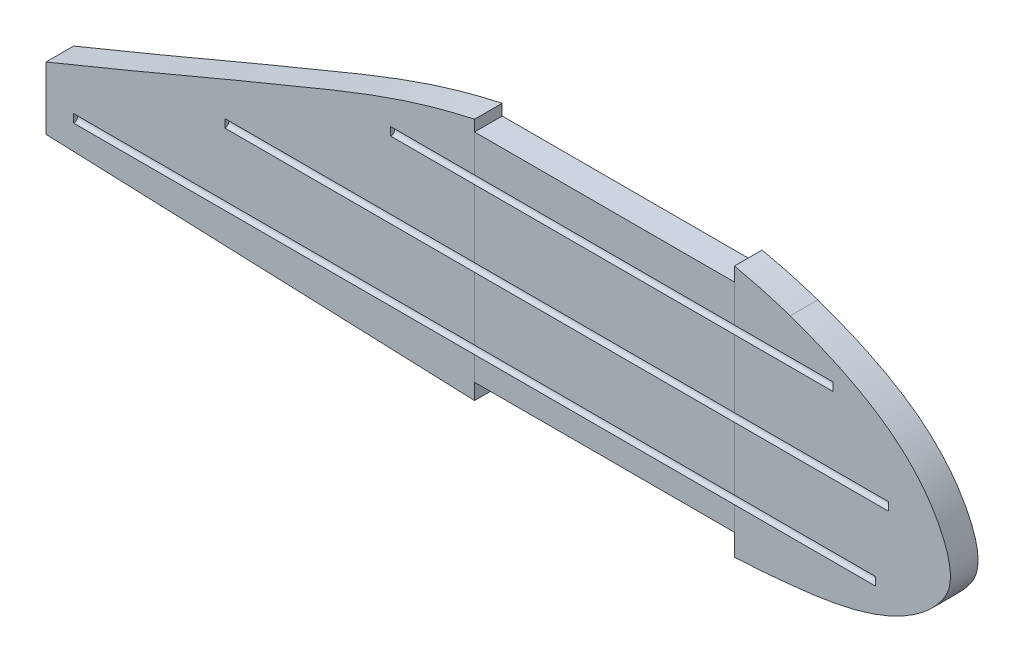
ISO-10303-21;
HEADER;
FILE_DESCRIPTION(('STEP AP214'),'2;1');
FILE_NAME('part.step','',(''),(''),'','','');
FILE_SCHEMA(('AUTOMOTIVE_DESIGN { 1 0 10303 214 1 1 1 1 }'));
ENDSEC;
DATA;
#1=APPLICATION_CONTEXT('core data for automotive mechanical design processes');
#2=APPLICATION_PROTOCOL_DEFINITION('international standard','automotive_design',2000,#1);
#3=PRODUCT_CONTEXT('',#1,'mechanical');
#4=PRODUCT('Part','Part','',(#3));
#5=PRODUCT_RELATED_PRODUCT_CATEGORY('part','',(#4));
#6=PRODUCT_DEFINITION_FORMATION('','',#4);
#7=PRODUCT_DEFINITION_CONTEXT('part definition',#1,'design');
#8=PRODUCT_DEFINITION('design','',#6,#7);
#9=PRODUCT_DEFINITION_SHAPE('','',#8);
#10=(LENGTH_UNIT() NAMED_UNIT(*) SI_UNIT(.MILLI.,.METRE.));
#11=(NAMED_UNIT(*) PLANE_ANGLE_UNIT() SI_UNIT($,.RADIAN.));
#12=(NAMED_UNIT(*) SI_UNIT($,.STERADIAN.) SOLID_ANGLE_UNIT());
#13=UNCERTAINTY_MEASURE_WITH_UNIT(LENGTH_MEASURE(1.E-05),#10,'distance_accuracy_value','');
#14=(GEOMETRIC_REPRESENTATION_CONTEXT(3) GLOBAL_UNCERTAINTY_ASSIGNED_CONTEXT((#13)) GLOBAL_UNIT_ASSIGNED_CONTEXT((#10,
#11,#12)) REPRESENTATION_CONTEXT('',''));
#15=CARTESIAN_POINT('',(0.,0.,0.));
#16=DIRECTION('',(0.,0.,1.));
#17=DIRECTION('',(1.,0.,0.));
#18=AXIS2_PLACEMENT_3D('',#15,#16,#17);
#19=CARTESIAN_POINT('',(0.,0.,0.));
#20=DIRECTION('',(0.,0.,1.));
#21=DIRECTION('',(1.,0.,0.));
#22=AXIS2_PLACEMENT_3D('',#19,#20,#21);
#23=PLANE('',#22);
#24=DIRECTION('',(-1.13502688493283E-11,-1.,0.));
#25=VECTOR('',#24,1.);
#26=CARTESIAN_POINT('',(112.438565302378,-1.27620794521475E-09,0.));
#27=LINE('',#26,#25);
#28=CARTESIAN_POINT('',(112.438565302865,34.6418888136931,0.));
#29=VERTEX_POINT('',#28);
#30=CARTESIAN_POINT('',(112.438565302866,-24.2968294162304,0.));
#31=VERTEX_POINT('',#30);
#32=EDGE_CURVE('E11',#29,#31,#27,.T.);
#33=ORIENTED_EDGE('',*,*,#32,.F.);
#34=CARTESIAN_POINT('',(94.5032612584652,41.9457104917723,0.));
#35=CARTESIAN_POINT('',(112.792285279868,35.396643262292,0.));
#36=CARTESIAN_POINT('',(135.085795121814,24.8841456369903,0.));
#37=CARTESIAN_POINT('',(149.376344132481,2.38674027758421,0.));
#38=CARTESIAN_POINT('',(152.743644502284,-7.75649035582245,0.));
#39=CARTESIAN_POINT('',(152.315910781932,-15.1660275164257,0.));
#40=CARTESIAN_POINT('',(147.688421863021,-22.7220622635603,0.));
#41=CARTESIAN_POINT('',(133.927469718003,-34.5207666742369,0.));
#42=CARTESIAN_POINT('',(112.357130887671,-40.4524885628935,0.));
#43=CARTESIAN_POINT('',(91.2592091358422,-42.5691353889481,0.));
#44=CARTESIAN_POINT('',(74.7608890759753,-43.9718199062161,0.));
#45=CARTESIAN_POINT('',(63.8435772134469,-43.9441119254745,0.));
#46=CARTESIAN_POINT('',(57.3057582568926,-44.0648618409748,0.));
#47=B_SPLINE_CURVE_WITH_KNOTS('',3,(#34,#35,#36,#37,#38,#39,#40,#41,#42,#43,#44,#45,#46),
.UNSPECIFIED.,.F.,.F.,(4,1,1,1,1,1,1,1,1,1,4),(0.59092756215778,0.703710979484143,
0.737073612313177,0.756629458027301,0.770481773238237,0.782245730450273,0.811517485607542,
0.882896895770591,0.918428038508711,0.946042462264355,0.987358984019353),.UNSPECIFIED.);
#48=CARTESIAN_POINT('',(112.438565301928,-39.6630401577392,0.));
#49=VERTEX_POINT('',#48);
#50=EDGE_CURVE('E270',#29,#49,#47,.T.);
#51=ORIENTED_EDGE('',*,*,#50,.T.);
#52=EDGE_CURVE('E51',#31,#49,#27,.T.);
#53=ORIENTED_EDGE('',*,*,#52,.F.);
#54=EDGE_LOOP('',(#33,#51,#53));
#55=FACE_BOUND('',#54,.T.);
#56=ADVANCED_FACE('F46',(#55),#23,.F.);
#57=DIRECTION('',(0.,-1.,0.));
#58=VECTOR('',#57,1.);
#59=CARTESIAN_POINT('',(-19.6614346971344,0.,0.));
#60=LINE('',#59,#58);
#61=CARTESIAN_POINT('',(-19.6614346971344,42.4371386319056,0.));
#62=VERTEX_POINT('',#61);
#63=CARTESIAN_POINT('',(-19.6614346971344,25.9710785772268,0.));
#64=VERTEX_POINT('',#63);
#65=EDGE_CURVE('E229',#62,#64,#60,.T.);
#66=ORIENTED_EDGE('',*,*,#65,.F.);
#67=DIRECTION('',(1.,0.,0.));
#68=VECTOR('',#67,1.);
#69=CARTESIAN_POINT('',(-19.6614346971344,42.4371386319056,0.));
#70=LINE('',#69,#68);
#71=CARTESIAN_POINT('',(74.3385653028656,42.4371386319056,0.));
#72=VERTEX_POINT('',#71);
#73=EDGE_CURVE('E508',#62,#72,#70,.T.);
#74=ORIENTED_EDGE('',*,*,#73,.T.);
#75=DIRECTION('',(0.,1.,0.));
#76=VECTOR('',#75,1.);
#77=CARTESIAN_POINT('',(74.3385653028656,-1.24407576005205E-13,0.));
#78=LINE('',#77,#76);
#79=CARTESIAN_POINT('',(74.3385653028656,25.9710785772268,0.));
#80=VERTEX_POINT('',#79);
#81=EDGE_CURVE('E244',#80,#72,#78,.T.);
#82=ORIENTED_EDGE('',*,*,#81,.F.);
#83=CARTESIAN_POINT('',(74.3385653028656,-1.5,0.));
#84=VERTEX_POINT('',#83);
#85=EDGE_CURVE('E242',#84,#80,#78,.T.);
#86=ORIENTED_EDGE('',*,*,#85,.F.);
#87=CARTESIAN_POINT('',(74.3385653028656,-35.9442899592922,0.));
#88=VERTEX_POINT('',#87);
#89=EDGE_CURVE('E237',#88,#84,#78,.T.);
#90=ORIENTED_EDGE('',*,*,#89,.F.);
#91=DIRECTION('',(-1.,0.,0.));
#92=VECTOR('',#91,1.);
#93=CARTESIAN_POINT('',(-19.6614346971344,-35.9442899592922,0.));
#94=LINE('',#93,#92);
#95=CARTESIAN_POINT('',(-19.6614346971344,-35.9442899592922,0.));
#96=VERTEX_POINT('',#95);
#97=EDGE_CURVE('E235',#88,#96,#94,.T.);
#98=ORIENTED_EDGE('',*,*,#97,.T.);
#99=CARTESIAN_POINT('',(-19.6614346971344,-1.5,0.));
#100=VERTEX_POINT('',#99);
#101=EDGE_CURVE('E227',#100,#96,#60,.T.);
#102=ORIENTED_EDGE('',*,*,#101,.F.);
#103=EDGE_CURVE('E222',#64,#100,#60,.T.);
#104=ORIENTED_EDGE('',*,*,#103,.F.);
#105=EDGE_LOOP('',(#66,#74,#82,#86,#90,#98,#102,#104));
#106=FACE_BOUND('',#105,.T.);
#107=ADVANCED_FACE('F233',(#106),#23,.F.);
#108=DIRECTION('',(0.,-1.,0.));
#109=VECTOR('',#108,1.);
#110=CARTESIAN_POINT('',(-19.6614346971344,46.4371386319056,0.));
#111=LINE('',#110,#109);
#112=CARTESIAN_POINT('',(-19.6614346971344,46.4371386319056,0.));
#113=VERTEX_POINT('',#112);
#114=EDGE_CURVE('E516',#113,#62,#111,.T.);
#115=ORIENTED_EDGE('',*,*,#114,.T.);
#116=ORIENTED_EDGE('',*,*,#65,.T.);
#117=ORIENTED_EDGE('',*,*,#103,.T.);
#118=ORIENTED_EDGE('',*,*,#101,.T.);
#119=DIRECTION('',(0.,-1.,0.));
#120=VECTOR('',#119,1.);
#121=CARTESIAN_POINT('',(-19.6614346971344,-35.9442899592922,0.));
#122=LINE('',#121,#120);
#123=CARTESIAN_POINT('',(-19.6614346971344,-41.6942899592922,0.));
#124=VERTEX_POINT('',#123);
#125=EDGE_CURVE('E418',#96,#124,#122,.T.);
#126=ORIENTED_EDGE('',*,*,#125,.T.);
#127=DIRECTION('',(0.9992769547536,-0.0380206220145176,0.));
#128=VECTOR('',#127,1.);
#129=CARTESIAN_POINT('',(-1.61251857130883,-42.3810175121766,0.));
#130=LINE('',#129,#128);
#131=CARTESIAN_POINT('',(-174.661434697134,-35.7968294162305,0.));
#132=VERTEX_POINT('',#131);
#133=EDGE_CURVE('E273',#132,#124,#130,.T.);
#134=ORIENTED_EDGE('',*,*,#133,.F.);
#135=DIRECTION('',(0.,1.,0.));
#136=VECTOR('',#135,1.);
#137=CARTESIAN_POINT('',(-174.661434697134,0.,0.));
#138=LINE('',#137,#136);
#139=CARTESIAN_POINT('',(-174.661434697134,-13.1321506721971,0.));
#140=VERTEX_POINT('',#139);
#141=EDGE_CURVE('E464',#132,#140,#138,.T.);
#142=ORIENTED_EDGE('',*,*,#141,.T.);
#143=CARTESIAN_POINT('',(-174.661434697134,-13.1321506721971,0.));
#144=CARTESIAN_POINT('',(-142.163116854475,0.00598019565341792,0.));
#145=CARTESIAN_POINT('',(-98.8204800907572,18.900773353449,0.));
#146=CARTESIAN_POINT('',(-48.1017897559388,39.122679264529,0.));
#147=CARTESIAN_POINT('',(-18.5580479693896,47.173994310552,0.));
#148=CARTESIAN_POINT('',(27.5229643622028,54.6535327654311,0.));
#149=CARTESIAN_POINT('',(67.5234551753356,50.9966753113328,0.));
#150=CARTESIAN_POINT('',(94.5032612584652,41.9457104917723,0.));
#151=B_SPLINE_CURVE_WITH_KNOTS('',3,(#143,#144,#145,#146,#147,#148,#149,#150),.UNSPECIFIED.,.F.,
.F.,(4,1,1,1,1,4),(0.,0.372977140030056,0.504219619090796,0.580660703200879,0.698668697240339,
1.),.UNSPECIFIED.);
#152=EDGE_CURVE('E311',#140,#113,#151,.T.);
#153=ORIENTED_EDGE('',*,*,#152,.T.);
#154=EDGE_LOOP('',(#115,#116,#117,#118,#126,#134,#142,#153));
#155=FACE_BOUND('',#154,.T.);
#156=ADVANCED_FACE('F225',(#155),#23,.F.);
#157=CARTESIAN_POINT('',(0.,0.,10.));
#158=DIRECTION('',(0.,0.,1.));
#159=DIRECTION('',(1.,0.,0.));
#160=AXIS2_PLACEMENT_3D('',#157,#158,#159);
#161=PLANE('',#160);
#162=DIRECTION('',(-1.,0.,0.));
#163=VECTOR('',#162,1.);
#164=CARTESIAN_POINT('',(110.,28.9710785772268,10.));
#165=LINE('',#164,#163);
#166=CARTESIAN_POINT('',(74.3385653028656,28.9710785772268,10.));
#167=VERTEX_POINT('',#166);
#168=CARTESIAN_POINT('',(-19.6614346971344,28.9710785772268,10.));
#169=VERTEX_POINT('',#168);
#170=EDGE_CURVE('E543',#167,#169,#165,.T.);
#171=ORIENTED_EDGE('',*,*,#170,.F.);
#172=DIRECTION('',(0.,1.,0.));
#173=VECTOR('',#172,1.);
#174=CARTESIAN_POINT('',(74.3385653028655,-1.47027135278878E-13,10.));
#175=LINE('',#174,#173);
#176=CARTESIAN_POINT('',(74.3385653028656,42.4371386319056,10.));
#177=VERTEX_POINT('',#176);
#178=EDGE_CURVE('E400',#167,#177,#175,.T.);
#179=ORIENTED_EDGE('',*,*,#178,.T.);
#180=DIRECTION('',(1.,0.,0.));
#181=VECTOR('',#180,1.);
#182=CARTESIAN_POINT('',(-19.6614346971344,42.4371386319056,10.));
#183=LINE('',#182,#181);
#184=CARTESIAN_POINT('',(-19.6614346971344,42.4371386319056,10.));
#185=VERTEX_POINT('',#184);
#186=EDGE_CURVE('E505',#185,#177,#183,.T.);
#187=ORIENTED_EDGE('',*,*,#186,.F.);
#188=DIRECTION('',(0.,1.,0.));
#189=VECTOR('',#188,1.);
#190=CARTESIAN_POINT('',(-19.6614346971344,0.,10.));
#191=LINE('',#190,#189);
#192=EDGE_CURVE('E401',#169,#185,#191,.T.);
#193=ORIENTED_EDGE('',*,*,#192,.F.);
#194=EDGE_LOOP('',(#171,#179,#187,#193));
#195=FACE_BOUND('',#194,.T.);
#196=ADVANCED_FACE('F352',(#195),#161,.T.);
#197=DIRECTION('',(-1.,0.,0.));
#198=VECTOR('',#197,1.);
#199=CARTESIAN_POINT('',(110.,25.9710785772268,10.));
#200=LINE('',#199,#198);
#201=CARTESIAN_POINT('',(-19.6614346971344,25.9710785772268,10.));
#202=VERTEX_POINT('',#201);
#203=CARTESIAN_POINT('',(74.3385653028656,25.9710785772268,10.));
#204=VERTEX_POINT('',#203);
#205=EDGE_CURVE('E547',#202,#204,#200,.F.);
#206=ORIENTED_EDGE('',*,*,#205,.F.);
#207=CARTESIAN_POINT('',(-19.6614346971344,1.5,10.));
#208=VERTEX_POINT('',#207);
#209=EDGE_CURVE('E393',#208,#202,#191,.T.);
#210=ORIENTED_EDGE('',*,*,#209,.F.);
#211=DIRECTION('',(-1.,0.,0.));
#212=VECTOR('',#211,1.);
#213=CARTESIAN_POINT('',(130.,1.5,10.));
#214=LINE('',#213,#212);
#215=CARTESIAN_POINT('',(74.3385653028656,1.5,10.));
#216=VERTEX_POINT('',#215);
#217=EDGE_CURVE('E535',#216,#208,#214,.T.);
#218=ORIENTED_EDGE('',*,*,#217,.F.);
#219=EDGE_CURVE('E564',#216,#204,#175,.T.);
#220=ORIENTED_EDGE('',*,*,#219,.T.);
#221=EDGE_LOOP('',(#206,#210,#218,#220));
#222=FACE_BOUND('',#221,.T.);
#223=ADVANCED_FACE('F356',(#222),#161,.T.);
#224=DIRECTION('',(-1.,0.,0.));
#225=VECTOR('',#224,1.);
#226=CARTESIAN_POINT('',(130.,-1.5,10.));
#227=LINE('',#226,#225);
#228=CARTESIAN_POINT('',(-19.6614346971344,-1.5,10.));
#229=VERTEX_POINT('',#228);
#230=CARTESIAN_POINT('',(74.3385653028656,-1.5,10.));
#231=VERTEX_POINT('',#230);
#232=EDGE_CURVE('E374',#229,#231,#227,.F.);
#233=ORIENTED_EDGE('',*,*,#232,.F.);
#234=CARTESIAN_POINT('',(-19.6614346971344,-24.2968294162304,10.));
#235=VERTEX_POINT('',#234);
#236=EDGE_CURVE('E377',#235,#229,#191,.T.);
#237=ORIENTED_EDGE('',*,*,#236,.F.);
#238=DIRECTION('',(-1.,0.,0.));
#239=VECTOR('',#238,1.);
#240=CARTESIAN_POINT('',(125.338565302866,-24.2968294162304,10.));
#241=LINE('',#240,#239);
#242=CARTESIAN_POINT('',(74.3385653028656,-24.2968294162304,10.));
#243=VERTEX_POINT('',#242);
#244=EDGE_CURVE('E449',#235,#243,#241,.F.);
#245=ORIENTED_EDGE('',*,*,#244,.T.);
#246=EDGE_CURVE('E379',#243,#231,#175,.T.);
#247=ORIENTED_EDGE('',*,*,#246,.T.);
#248=EDGE_LOOP('',(#233,#237,#245,#247));
#249=FACE_BOUND('',#248,.T.);
#250=ADVANCED_FACE('F351',(#249),#161,.T.);
#251=CARTESIAN_POINT('',(74.3385653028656,-35.9442899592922,10.));
#252=VERTEX_POINT('',#251);
#253=CARTESIAN_POINT('',(74.3385653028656,-27.2968294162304,10.));
#254=VERTEX_POINT('',#253);
#255=EDGE_CURVE('E281',#252,#254,#175,.T.);
#256=ORIENTED_EDGE('',*,*,#255,.T.);
#257=DIRECTION('',(-1.,0.,0.));
#258=VECTOR('',#257,1.);
#259=CARTESIAN_POINT('',(125.338565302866,-27.2968294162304,10.));
#260=LINE('',#259,#258);
#261=CARTESIAN_POINT('',(-19.6614346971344,-27.2968294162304,10.));
#262=VERTEX_POINT('',#261);
#263=EDGE_CURVE('E460',#254,#262,#260,.T.);
#264=ORIENTED_EDGE('',*,*,#263,.T.);
#265=CARTESIAN_POINT('',(-19.6614346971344,-35.9442899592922,10.));
#266=VERTEX_POINT('',#265);
#267=EDGE_CURVE('E392',#266,#262,#191,.T.);
#268=ORIENTED_EDGE('',*,*,#267,.F.);
#269=DIRECTION('',(-1.,0.,0.));
#270=VECTOR('',#269,1.);
#271=CARTESIAN_POINT('',(-19.6614346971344,-35.9442899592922,10.));
#272=LINE('',#271,#270);
#273=EDGE_CURVE('E411',#252,#266,#272,.T.);
#274=ORIENTED_EDGE('',*,*,#273,.F.);
#275=EDGE_LOOP('',(#256,#264,#268,#274));
#276=FACE_BOUND('',#275,.T.);
#277=ADVANCED_FACE('F362',(#276),#161,.T.);
#278=DIRECTION('',(-1.,0.,0.));
#279=VECTOR('',#278,1.);
#280=CARTESIAN_POINT('',(110.,28.9710785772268,10.));
#281=LINE('',#280,#279);
#282=CARTESIAN_POINT('',(-50.,28.9710785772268,10.));
#283=VERTEX_POINT('',#282);
#284=EDGE_CURVE('E497',#169,#283,#281,.T.);
#285=ORIENTED_EDGE('',*,*,#284,.F.);
#286=ORIENTED_EDGE('',*,*,#192,.T.);
#287=DIRECTION('',(0.,-1.,0.));
#288=VECTOR('',#287,1.);
#289=CARTESIAN_POINT('',(-19.6614346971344,46.4371386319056,10.));
#290=LINE('',#289,#288);
#291=CARTESIAN_POINT('',(-19.6614346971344,46.4371386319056,10.));
#292=VERTEX_POINT('',#291);
#293=EDGE_CURVE('E410',#292,#185,#290,.T.);
#294=ORIENTED_EDGE('',*,*,#293,.F.);
#295=CARTESIAN_POINT('',(-174.661434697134,-13.1321506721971,10.));
#296=CARTESIAN_POINT('',(-142.163116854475,0.00598019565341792,10.));
#297=CARTESIAN_POINT('',(-98.8204800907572,18.900773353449,10.));
#298=CARTESIAN_POINT('',(-48.1017897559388,39.122679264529,10.));
#299=CARTESIAN_POINT('',(-18.5580479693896,47.173994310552,10.));
#300=CARTESIAN_POINT('',(27.5229643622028,54.6535327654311,10.));
#301=CARTESIAN_POINT('',(67.5234551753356,50.9966753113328,10.));
#302=CARTESIAN_POINT('',(94.5032612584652,41.9457104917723,10.));
#303=B_SPLINE_CURVE_WITH_KNOTS('',3,(#295,#296,#297,#298,#299,#300,#301,#302),.UNSPECIFIED.,.F.,
.F.,(4,1,1,1,1,4),(0.,0.372977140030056,0.504219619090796,0.580660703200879,0.698668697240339,
1.),.UNSPECIFIED.);
#304=CARTESIAN_POINT('',(-174.661434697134,-13.1321506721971,10.));
#305=VERTEX_POINT('',#304);
#306=EDGE_CURVE('E422',#305,#292,#303,.T.);
#307=ORIENTED_EDGE('',*,*,#306,.F.);
#308=DIRECTION('',(0.,1.,0.));
#309=VECTOR('',#308,1.);
#310=CARTESIAN_POINT('',(-174.661434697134,0.,10.));
#311=LINE('',#310,#309);
#312=CARTESIAN_POINT('',(-174.661434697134,-35.7968294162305,10.));
#313=VERTEX_POINT('',#312);
#314=EDGE_CURVE('E427',#313,#305,#311,.T.);
#315=ORIENTED_EDGE('',*,*,#314,.F.);
#316=DIRECTION('',(0.9992769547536,-0.0380206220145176,0.));
#317=VECTOR('',#316,1.);
#318=CARTESIAN_POINT('',(-1.61251857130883,-42.3810175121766,10.));
#319=LINE('',#318,#317);
#320=CARTESIAN_POINT('',(-19.6614346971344,-41.6942899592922,10.));
#321=VERTEX_POINT('',#320);
#322=EDGE_CURVE('E303',#313,#321,#319,.T.);
#323=ORIENTED_EDGE('',*,*,#322,.T.);
#324=DIRECTION('',(0.,-1.,0.));
#325=VECTOR('',#324,1.);
#326=CARTESIAN_POINT('',(-19.6614346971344,-35.9442899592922,10.));
#327=LINE('',#326,#325);
#328=EDGE_CURVE('E415',#266,#321,#327,.T.);
#329=ORIENTED_EDGE('',*,*,#328,.F.);
#330=ORIENTED_EDGE('',*,*,#267,.T.);
#331=DIRECTION('',(-1.,0.,0.));
#332=VECTOR('',#331,1.);
#333=CARTESIAN_POINT('',(125.338565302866,-27.2968294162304,10.));
#334=LINE('',#333,#332);
#335=CARTESIAN_POINT('',(-164.661434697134,-27.2968294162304,10.));
#336=VERTEX_POINT('',#335);
#337=EDGE_CURVE('E524',#262,#336,#334,.T.);
#338=ORIENTED_EDGE('',*,*,#337,.T.);
#339=DIRECTION('',(0.,-1.,0.));
#340=VECTOR('',#339,1.);
#341=CARTESIAN_POINT('',(-164.661434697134,0.,10.));
#342=LINE('',#341,#340);
#343=CARTESIAN_POINT('',(-164.661434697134,-24.2968294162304,10.));
#344=VERTEX_POINT('',#343);
#345=EDGE_CURVE('E613',#344,#336,#342,.T.);
#346=ORIENTED_EDGE('',*,*,#345,.F.);
#347=DIRECTION('',(-1.,0.,0.));
#348=VECTOR('',#347,1.);
#349=CARTESIAN_POINT('',(125.338565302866,-24.2968294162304,10.));
#350=LINE('',#349,#348);
#351=EDGE_CURVE('E390',#344,#235,#350,.F.);
#352=ORIENTED_EDGE('',*,*,#351,.T.);
#353=ORIENTED_EDGE('',*,*,#236,.T.);
#354=DIRECTION('',(-1.,0.,0.));
#355=VECTOR('',#354,1.);
#356=CARTESIAN_POINT('',(130.,-1.5,10.));
#357=LINE('',#356,#355);
#358=CARTESIAN_POINT('',(-110.,-1.5,10.));
#359=VERTEX_POINT('',#358);
#360=EDGE_CURVE('E382',#359,#229,#357,.F.);
#361=ORIENTED_EDGE('',*,*,#360,.F.);
#362=DIRECTION('',(0.,1.,0.));
#363=VECTOR('',#362,1.);
#364=CARTESIAN_POINT('',(-110.,0.,10.));
#365=LINE('',#364,#363);
#366=CARTESIAN_POINT('',(-110.,1.5,10.));
#367=VERTEX_POINT('',#366);
#368=EDGE_CURVE('E573',#359,#367,#365,.T.);
#369=ORIENTED_EDGE('',*,*,#368,.T.);
#370=DIRECTION('',(-1.,0.,0.));
#371=VECTOR('',#370,1.);
#372=CARTESIAN_POINT('',(130.,1.5,10.));
#373=LINE('',#372,#371);
#374=EDGE_CURVE('E531',#208,#367,#373,.T.);
#375=ORIENTED_EDGE('',*,*,#374,.F.);
#376=ORIENTED_EDGE('',*,*,#209,.T.);
#377=DIRECTION('',(-1.,0.,0.));
#378=VECTOR('',#377,1.);
#379=CARTESIAN_POINT('',(110.,25.9710785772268,10.));
#380=LINE('',#379,#378);
#381=CARTESIAN_POINT('',(-50.,25.9710785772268,10.));
#382=VERTEX_POINT('',#381);
#383=EDGE_CURVE('E545',#382,#202,#380,.F.);
#384=ORIENTED_EDGE('',*,*,#383,.F.);
#385=DIRECTION('',(0.,1.,0.));
#386=VECTOR('',#385,1.);
#387=CARTESIAN_POINT('',(-50.,0.,10.));
#388=LINE('',#387,#386);
#389=EDGE_CURVE('E558',#382,#283,#388,.T.);
#390=ORIENTED_EDGE('',*,*,#389,.T.);
#391=EDGE_LOOP('',(#285,#286,#294,#307,#315,#323,#329,#330,#338,#346,#352,#353,#361,#369,#375,
#376,#384,#390));
#392=FACE_BOUND('',#391,.T.);
#393=ADVANCED_FACE('F349',(#392),#161,.T.);
#394=DIRECTION('',(-1.,0.,0.));
#395=VECTOR('',#394,1.);
#396=CARTESIAN_POINT('',(110.,28.9710785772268,10.));
#397=LINE('',#396,#395);
#398=CARTESIAN_POINT('',(110.,28.9710785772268,10.));
#399=VERTEX_POINT('',#398);
#400=EDGE_CURVE('E570',#399,#167,#397,.T.);
#401=ORIENTED_EDGE('',*,*,#400,.F.);
#402=DIRECTION('',(0.,1.,0.));
#403=VECTOR('',#402,1.);
#404=CARTESIAN_POINT('',(110.,0.,10.));
#405=LINE('',#404,#403);
#406=CARTESIAN_POINT('',(110.,25.9710785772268,10.));
#407=VERTEX_POINT('',#406);
#408=EDGE_CURVE('E569',#407,#399,#405,.T.);
#409=ORIENTED_EDGE('',*,*,#408,.F.);
#410=DIRECTION('',(-1.,0.,0.));
#411=VECTOR('',#410,1.);
#412=CARTESIAN_POINT('',(110.,25.9710785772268,10.));
#413=LINE('',#412,#411);
#414=EDGE_CURVE('E566',#204,#407,#413,.F.);
#415=ORIENTED_EDGE('',*,*,#414,.F.);
#416=ORIENTED_EDGE('',*,*,#219,.F.);
#417=DIRECTION('',(-1.,0.,0.));
#418=VECTOR('',#417,1.);
#419=CARTESIAN_POINT('',(130.,1.5,10.));
#420=LINE('',#419,#418);
#421=CARTESIAN_POINT('',(130.,1.5,10.));
#422=VERTEX_POINT('',#421);
#423=EDGE_CURVE('E619',#422,#216,#420,.T.);
#424=ORIENTED_EDGE('',*,*,#423,.F.);
#425=DIRECTION('',(0.,1.,0.));
#426=VECTOR('',#425,1.);
#427=CARTESIAN_POINT('',(130.,0.,10.));
#428=LINE('',#427,#426);
#429=CARTESIAN_POINT('',(130.,-1.5,10.));
#430=VERTEX_POINT('',#429);
#431=EDGE_CURVE('E615',#430,#422,#428,.T.);
#432=ORIENTED_EDGE('',*,*,#431,.F.);
#433=DIRECTION('',(-1.,0.,0.));
#434=VECTOR('',#433,1.);
#435=CARTESIAN_POINT('',(130.,-1.5,10.));
#436=LINE('',#435,#434);
#437=EDGE_CURVE('E617',#231,#430,#436,.F.);
#438=ORIENTED_EDGE('',*,*,#437,.F.);
#439=ORIENTED_EDGE('',*,*,#246,.F.);
#440=DIRECTION('',(-1.,0.,0.));
#441=VECTOR('',#440,1.);
#442=CARTESIAN_POINT('',(125.338565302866,-24.2968294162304,10.));
#443=LINE('',#442,#441);
#444=CARTESIAN_POINT('',(125.338565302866,-24.2968294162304,10.));
#445=VERTEX_POINT('',#444);
#446=EDGE_CURVE('E609',#243,#445,#443,.F.);
#447=ORIENTED_EDGE('',*,*,#446,.T.);
#448=DIRECTION('',(0.,-1.,0.));
#449=VECTOR('',#448,1.);
#450=CARTESIAN_POINT('',(125.338565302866,0.,10.));
#451=LINE('',#450,#449);
#452=CARTESIAN_POINT('',(125.338565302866,-27.2968294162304,10.));
#453=VERTEX_POINT('',#452);
#454=EDGE_CURVE('E601',#445,#453,#451,.T.);
#455=ORIENTED_EDGE('',*,*,#454,.T.);
#456=DIRECTION('',(-1.,0.,0.));
#457=VECTOR('',#456,1.);
#458=CARTESIAN_POINT('',(125.338565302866,-27.2968294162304,10.));
#459=LINE('',#458,#457);
#460=EDGE_CURVE('E605',#453,#254,#459,.T.);
#461=ORIENTED_EDGE('',*,*,#460,.T.);
#462=ORIENTED_EDGE('',*,*,#255,.F.);
#463=DIRECTION('',(0.,1.,0.));
#464=VECTOR('',#463,1.);
#465=CARTESIAN_POINT('',(74.3385653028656,-35.9442899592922,10.));
#466=LINE('',#465,#464);
#467=CARTESIAN_POINT('',(74.3385653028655,-43.7468645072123,10.));
#468=VERTEX_POINT('',#467);
#469=EDGE_CURVE('E407',#468,#252,#466,.T.);
#470=ORIENTED_EDGE('',*,*,#469,.F.);
#471=CARTESIAN_POINT('',(94.5032612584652,41.9457104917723,10.));
#472=CARTESIAN_POINT('',(112.792285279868,35.396643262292,10.));
#473=CARTESIAN_POINT('',(135.085795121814,24.8841456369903,10.));
#474=CARTESIAN_POINT('',(149.376344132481,2.38674027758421,10.));
#475=CARTESIAN_POINT('',(152.743644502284,-7.75649035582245,10.));
#476=CARTESIAN_POINT('',(152.315910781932,-15.1660275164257,10.));
#477=CARTESIAN_POINT('',(147.688421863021,-22.7220622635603,10.));
#478=CARTESIAN_POINT('',(133.927469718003,-34.5207666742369,10.));
#479=CARTESIAN_POINT('',(112.357130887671,-40.4524885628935,10.));
#480=CARTESIAN_POINT('',(91.2592091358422,-42.5691353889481,10.));
#481=CARTESIAN_POINT('',(74.7608890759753,-43.9718199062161,10.));
#482=CARTESIAN_POINT('',(63.8435772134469,-43.9441119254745,10.));
#483=CARTESIAN_POINT('',(57.3057582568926,-44.0648618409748,10.));
#484=B_SPLINE_CURVE_WITH_KNOTS('',3,(#471,#472,#473,#474,#475,#476,#477,#478,#479,#480,#481,
#482,#483),.UNSPECIFIED.,.F.,.F.,(4,1,1,1,1,1,1,1,1,1,4),(0.59092756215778,0.703710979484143,
0.737073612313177,0.756629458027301,0.770481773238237,0.782245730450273,0.811517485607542,
0.882896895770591,0.918428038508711,0.946042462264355,0.987358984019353),.UNSPECIFIED.);
#485=CARTESIAN_POINT('',(94.5032612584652,41.9457104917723,10.));
#486=VERTEX_POINT('',#485);
#487=EDGE_CURVE('E300',#486,#468,#484,.T.);
#488=ORIENTED_EDGE('',*,*,#487,.F.);
#489=CARTESIAN_POINT('',(74.3385653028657,47.4710785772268,10.));
#490=VERTEX_POINT('',#489);
#491=EDGE_CURVE('E277',#490,#486,#303,.T.);
#492=ORIENTED_EDGE('',*,*,#491,.F.);
#493=DIRECTION('',(0.,1.,0.));
#494=VECTOR('',#493,1.);
#495=CARTESIAN_POINT('',(74.3385653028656,42.4371386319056,10.));
#496=LINE('',#495,#494);
#497=EDGE_CURVE('E514',#177,#490,#496,.T.);
#498=ORIENTED_EDGE('',*,*,#497,.F.);
#499=ORIENTED_EDGE('',*,*,#178,.F.);
#500=EDGE_LOOP('',(#401,#409,#415,#416,#424,#432,#438,#439,#447,#455,#461,#462,#470,#488,#492,
#498,#499));
#501=FACE_BOUND('',#500,.T.);
#502=ADVANCED_FACE('F343',(#501),#161,.T.);
#503=CARTESIAN_POINT('',(94.5032612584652,41.9457104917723,0.));
#504=VERTEX_POINT('',#503);
#505=EDGE_CURVE('E275',#504,#29,#47,.T.);
#506=ORIENTED_EDGE('',*,*,#505,.T.);
#507=ORIENTED_EDGE('',*,*,#32,.T.);
#508=ORIENTED_EDGE('',*,*,#52,.T.);
#509=CARTESIAN_POINT('',(74.3385653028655,-43.7468645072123,0.));
#510=VERTEX_POINT('',#509);
#511=EDGE_CURVE('E261',#49,#510,#47,.T.);
#512=ORIENTED_EDGE('',*,*,#511,.T.);
#513=DIRECTION('',(0.,1.,0.));
#514=VECTOR('',#513,1.);
#515=CARTESIAN_POINT('',(74.3385653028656,-35.9442899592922,0.));
#516=LINE('',#515,#514);
#517=EDGE_CURVE('E414',#510,#88,#516,.T.);
#518=ORIENTED_EDGE('',*,*,#517,.T.);
#519=ORIENTED_EDGE('',*,*,#89,.T.);
#520=ORIENTED_EDGE('',*,*,#85,.T.);
#521=ORIENTED_EDGE('',*,*,#81,.T.);
#522=DIRECTION('',(0.,1.,0.));
#523=VECTOR('',#522,1.);
#524=CARTESIAN_POINT('',(74.3385653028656,42.4371386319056,0.));
#525=LINE('',#524,#523);
#526=CARTESIAN_POINT('',(74.3385653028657,47.4710785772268,0.));
#527=VERTEX_POINT('',#526);
#528=EDGE_CURVE('E519',#72,#527,#525,.T.);
#529=ORIENTED_EDGE('',*,*,#528,.T.);
#530=EDGE_CURVE('E466',#527,#504,#151,.T.);
#531=ORIENTED_EDGE('',*,*,#530,.T.);
#532=EDGE_LOOP('',(#506,#507,#508,#512,#518,#519,#520,#521,#529,#531));
#533=FACE_BOUND('',#532,.T.);
#534=ADVANCED_FACE('F259',(#533),#23,.F.);
#535=DIRECTION('',(0.,0.,-1.));
#536=VECTOR('',#535,1.);
#537=SURFACE_OF_LINEAR_EXTRUSION('',#303,#536);
#538=DIRECTION('',(0.,0.,-1.));
#539=VECTOR('',#538,1.);
#540=CARTESIAN_POINT('',(74.3385653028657,47.4710785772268,5.));
#541=LINE('',#540,#539);
#542=EDGE_CURVE('E467',#527,#490,#541,.F.);
#543=ORIENTED_EDGE('',*,*,#542,.T.);
#544=ORIENTED_EDGE('',*,*,#491,.T.);
#545=DIRECTION('',(0.,0.,-1.));
#546=VECTOR('',#545,1.);
#547=CARTESIAN_POINT('',(94.5032612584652,41.9457104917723,10.));
#548=LINE('',#547,#546);
#549=EDGE_CURVE('E290',#486,#504,#548,.T.);
#550=ORIENTED_EDGE('',*,*,#549,.T.);
#551=ORIENTED_EDGE('',*,*,#530,.F.);
#552=EDGE_LOOP('',(#543,#544,#550,#551));
#553=FACE_BOUND('',#552,.T.);
#554=ADVANCED_FACE('F334',(#553),#537,.T.);
#555=DIRECTION('',(0.,0.,-1.));
#556=VECTOR('',#555,1.);
#557=CARTESIAN_POINT('',(-19.6614346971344,46.4371386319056,5.));
#558=LINE('',#557,#556);
#559=EDGE_CURVE('E479',#113,#292,#558,.F.);
#560=ORIENTED_EDGE('',*,*,#559,.F.);
#561=ORIENTED_EDGE('',*,*,#152,.F.);
#562=DIRECTION('',(0.,0.,-1.));
#563=VECTOR('',#562,1.);
#564=CARTESIAN_POINT('',(-174.661434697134,-13.1321506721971,10.));
#565=LINE('',#564,#563);
#566=EDGE_CURVE('E299',#305,#140,#565,.T.);
#567=ORIENTED_EDGE('',*,*,#566,.F.);
#568=ORIENTED_EDGE('',*,*,#306,.T.);
#569=EDGE_LOOP('',(#560,#561,#567,#568));
#570=FACE_BOUND('',#569,.T.);
#571=ADVANCED_FACE('F48',(#570),#537,.T.);
#572=CARTESIAN_POINT('',(-174.661434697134,0.,10.));
#573=DIRECTION('',(-1.,0.,0.));
#574=DIRECTION('',(0.,0.,1.));
#575=AXIS2_PLACEMENT_3D('',#572,#573,#574);
#576=PLANE('',#575);
#577=ORIENTED_EDGE('',*,*,#141,.F.);
#578=DIRECTION('',(0.,0.,-1.));
#579=VECTOR('',#578,1.);
#580=CARTESIAN_POINT('',(-174.661434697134,-35.7968294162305,10.));
#581=LINE('',#580,#579);
#582=EDGE_CURVE('E439',#313,#132,#581,.T.);
#583=ORIENTED_EDGE('',*,*,#582,.F.);
#584=ORIENTED_EDGE('',*,*,#314,.T.);
#585=ORIENTED_EDGE('',*,*,#566,.T.);
#586=EDGE_LOOP('',(#577,#583,#584,#585));
#587=FACE_BOUND('',#586,.T.);
#588=ADVANCED_FACE('F326',(#587),#576,.T.);
#589=CARTESIAN_POINT('',(-1.61251857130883,-42.3810175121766,10.));
#590=DIRECTION('',(0.0380206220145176,0.9992769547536,0.));
#591=DIRECTION('',(-0.9992769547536,0.0380206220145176,0.));
#592=AXIS2_PLACEMENT_3D('',#589,#590,#591);
#593=PLANE('',#592);
#594=ORIENTED_EDGE('',*,*,#133,.T.);
#595=DIRECTION('',(0.,0.,1.));
#596=VECTOR('',#595,1.);
#597=CARTESIAN_POINT('',(-19.6614346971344,-41.6942899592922,0.));
#598=LINE('',#597,#596);
#599=EDGE_CURVE('E441',#124,#321,#598,.T.);
#600=ORIENTED_EDGE('',*,*,#599,.T.);
#601=ORIENTED_EDGE('',*,*,#322,.F.);
#602=ORIENTED_EDGE('',*,*,#582,.T.);
#603=EDGE_LOOP('',(#594,#600,#601,#602));
#604=FACE_BOUND('',#603,.T.);
#605=ADVANCED_FACE('F323',(#604),#593,.F.);
#606=DIRECTION('',(0.,0.,-1.));
#607=VECTOR('',#606,1.);
#608=SURFACE_OF_LINEAR_EXTRUSION('',#484,#607);
#609=DIRECTION('',(0.,0.,-1.));
#610=VECTOR('',#609,1.);
#611=CARTESIAN_POINT('',(74.3385653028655,-43.7468645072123,5.));
#612=LINE('',#611,#610);
#613=EDGE_CURVE('E272',#510,#468,#612,.F.);
#614=ORIENTED_EDGE('',*,*,#613,.F.);
#615=ORIENTED_EDGE('',*,*,#511,.F.);
#616=ORIENTED_EDGE('',*,*,#50,.F.);
#617=ORIENTED_EDGE('',*,*,#505,.F.);
#618=ORIENTED_EDGE('',*,*,#549,.F.);
#619=ORIENTED_EDGE('',*,*,#487,.T.);
#620=EDGE_LOOP('',(#614,#615,#616,#617,#618,#619));
#621=FACE_BOUND('',#620,.T.);
#622=ADVANCED_FACE('F268',(#621),#608,.T.);
#623=CARTESIAN_POINT('',(-19.6614346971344,-35.9442899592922,0.));
#624=DIRECTION('',(-1.,0.,0.));
#625=DIRECTION('',(0.,-1.,0.));
#626=AXIS2_PLACEMENT_3D('',#623,#624,#625);
#627=PLANE('',#626);
#628=ORIENTED_EDGE('',*,*,#328,.T.);
#629=ORIENTED_EDGE('',*,*,#599,.F.);
#630=ORIENTED_EDGE('',*,*,#125,.F.);
#631=DIRECTION('',(0.,0.,1.));
#632=VECTOR('',#631,1.);
#633=CARTESIAN_POINT('',(-19.6614346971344,-35.9442899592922,0.));
#634=LINE('',#633,#632);
#635=EDGE_CURVE('E444',#96,#266,#634,.T.);
#636=ORIENTED_EDGE('',*,*,#635,.T.);
#637=EDGE_LOOP('',(#628,#629,#630,#636));
#638=FACE_BOUND('',#637,.T.);
#639=ADVANCED_FACE('F322',(#638),#627,.F.);
#640=CARTESIAN_POINT('',(-19.6614346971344,-35.9442899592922,0.));
#641=DIRECTION('',(0.,1.,0.));
#642=DIRECTION('',(0.,0.,1.));
#643=AXIS2_PLACEMENT_3D('',#640,#641,#642);
#644=PLANE('',#643);
#645=ORIENTED_EDGE('',*,*,#273,.T.);
#646=ORIENTED_EDGE('',*,*,#635,.F.);
#647=ORIENTED_EDGE('',*,*,#97,.F.);
#648=DIRECTION('',(0.,0.,1.));
#649=VECTOR('',#648,1.);
#650=CARTESIAN_POINT('',(74.3385653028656,-35.9442899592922,0.));
#651=LINE('',#650,#649);
#652=EDGE_CURVE('E447',#88,#252,#651,.T.);
#653=ORIENTED_EDGE('',*,*,#652,.T.);
#654=EDGE_LOOP('',(#645,#646,#647,#653));
#655=FACE_BOUND('',#654,.T.);
#656=ADVANCED_FACE('F456',(#655),#644,.F.);
#657=CARTESIAN_POINT('',(74.3385653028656,-35.9442899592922,0.));
#658=DIRECTION('',(1.,0.,0.));
#659=DIRECTION('',(0.,1.,0.));
#660=AXIS2_PLACEMENT_3D('',#657,#658,#659);
#661=PLANE('',#660);
#662=ORIENTED_EDGE('',*,*,#469,.T.);
#663=ORIENTED_EDGE('',*,*,#652,.F.);
#664=ORIENTED_EDGE('',*,*,#517,.F.);
#665=ORIENTED_EDGE('',*,*,#613,.T.);
#666=EDGE_LOOP('',(#662,#663,#664,#665));
#667=FACE_BOUND('',#666,.T.);
#668=ADVANCED_FACE('F483',(#667),#661,.F.);
#669=CARTESIAN_POINT('',(74.3385653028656,42.4371386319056,0.));
#670=DIRECTION('',(1.,0.,0.));
#671=DIRECTION('',(0.,0.,-1.));
#672=AXIS2_PLACEMENT_3D('',#669,#670,#671);
#673=PLANE('',#672);
#674=ORIENTED_EDGE('',*,*,#497,.T.);
#675=ORIENTED_EDGE('',*,*,#542,.F.);
#676=ORIENTED_EDGE('',*,*,#528,.F.);
#677=DIRECTION('',(0.,0.,1.));
#678=VECTOR('',#677,1.);
#679=CARTESIAN_POINT('',(74.3385653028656,42.4371386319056,0.));
#680=LINE('',#679,#678);
#681=EDGE_CURVE('E472',#72,#177,#680,.T.);
#682=ORIENTED_EDGE('',*,*,#681,.T.);
#683=EDGE_LOOP('',(#674,#675,#676,#682));
#684=FACE_BOUND('',#683,.T.);
#685=ADVANCED_FACE('F597',(#684),#673,.F.);
#686=CARTESIAN_POINT('',(-19.6614346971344,42.4371386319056,0.));
#687=DIRECTION('',(0.,-1.,0.));
#688=DIRECTION('',(1.,0.,0.));
#689=AXIS2_PLACEMENT_3D('',#686,#687,#688);
#690=PLANE('',#689);
#691=ORIENTED_EDGE('',*,*,#186,.T.);
#692=ORIENTED_EDGE('',*,*,#681,.F.);
#693=ORIENTED_EDGE('',*,*,#73,.F.);
#694=DIRECTION('',(0.,0.,1.));
#695=VECTOR('',#694,1.);
#696=CARTESIAN_POINT('',(-19.6614346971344,42.4371386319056,0.));
#697=LINE('',#696,#695);
#698=EDGE_CURVE('E476',#62,#185,#697,.T.);
#699=ORIENTED_EDGE('',*,*,#698,.T.);
#700=EDGE_LOOP('',(#691,#692,#693,#699));
#701=FACE_BOUND('',#700,.T.);
#702=ADVANCED_FACE('F503',(#701),#690,.F.);
#703=CARTESIAN_POINT('',(-19.6614346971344,46.4371386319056,0.));
#704=DIRECTION('',(-1.,0.,0.));
#705=DIRECTION('',(0.,-1.,0.));
#706=AXIS2_PLACEMENT_3D('',#703,#704,#705);
#707=PLANE('',#706);
#708=ORIENTED_EDGE('',*,*,#293,.T.);
#709=ORIENTED_EDGE('',*,*,#698,.F.);
#710=ORIENTED_EDGE('',*,*,#114,.F.);
#711=ORIENTED_EDGE('',*,*,#559,.T.);
#712=EDGE_LOOP('',(#708,#709,#710,#711));
#713=FACE_BOUND('',#712,.T.);
#714=ADVANCED_FACE('F510',(#713),#707,.F.);
#715=CARTESIAN_POINT('',(125.338565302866,-25.7968294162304,10.));
#716=DIRECTION('',(-1.,0.,0.));
#717=DIRECTION('',(0.,0.,1.));
#718=AXIS2_PLACEMENT_3D('',#715,#716,#717);
#719=CYLINDRICAL_SURFACE('',#718,1.5);
#720=CARTESIAN_POINT('',(-164.661434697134,-25.7968294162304,10.));
#721=DIRECTION('',(1.,0.,0.));
#722=DIRECTION('',(0.,0.,-1.));
#723=AXIS2_PLACEMENT_3D('',#720,#721,#722);
#724=CIRCLE('',#723,1.5);
#725=EDGE_CURVE('E528',#336,#344,#724,.T.);
#726=ORIENTED_EDGE('',*,*,#725,.F.);
#727=ORIENTED_EDGE('',*,*,#337,.F.);
#728=ORIENTED_EDGE('',*,*,#263,.F.);
#729=ORIENTED_EDGE('',*,*,#460,.F.);
#730=CARTESIAN_POINT('',(125.338565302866,-25.7968294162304,10.));
#731=DIRECTION('',(1.,0.,0.));
#732=DIRECTION('',(0.,0.,-1.));
#733=AXIS2_PLACEMENT_3D('',#730,#731,#732);
#734=CIRCLE('',#733,1.5);
#735=EDGE_CURVE('E527',#453,#445,#734,.T.);
#736=ORIENTED_EDGE('',*,*,#735,.T.);
#737=ORIENTED_EDGE('',*,*,#446,.F.);
#738=ORIENTED_EDGE('',*,*,#244,.F.);
#739=ORIENTED_EDGE('',*,*,#351,.F.);
#740=EDGE_LOOP('',(#726,#727,#728,#729,#736,#737,#738,#739));
#741=FACE_BOUND('',#740,.T.);
#742=ADVANCED_FACE('F640',(#741),#719,.F.);
#743=CARTESIAN_POINT('',(125.338565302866,-25.7968294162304,10.));
#744=DIRECTION('',(-1.,0.,0.));
#745=DIRECTION('',(0.,0.,-1.));
#746=AXIS2_PLACEMENT_3D('',#743,#744,#745);
#747=PLANE('',#746);
#748=ORIENTED_EDGE('',*,*,#735,.F.);
#749=ORIENTED_EDGE('',*,*,#454,.F.);
#750=EDGE_LOOP('',(#748,#749));
#751=FACE_BOUND('',#750,.T.);
#752=ADVANCED_FACE('F637',(#751),#747,.T.);
#753=CARTESIAN_POINT('',(-164.661434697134,-25.7968294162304,10.));
#754=DIRECTION('',(-1.,0.,0.));
#755=DIRECTION('',(0.,0.,-1.));
#756=AXIS2_PLACEMENT_3D('',#753,#754,#755);
#757=PLANE('',#756);
#758=ORIENTED_EDGE('',*,*,#345,.T.);
#759=ORIENTED_EDGE('',*,*,#725,.T.);
#760=EDGE_LOOP('',(#758,#759));
#761=FACE_BOUND('',#760,.T.);
#762=ADVANCED_FACE('F633',(#761),#757,.F.);
#763=CARTESIAN_POINT('',(130.,0.,10.));
#764=DIRECTION('',(-1.,0.,0.));
#765=DIRECTION('',(0.,0.,1.));
#766=AXIS2_PLACEMENT_3D('',#763,#764,#765);
#767=CYLINDRICAL_SURFACE('',#766,1.5);
#768=ORIENTED_EDGE('',*,*,#374,.T.);
#769=CARTESIAN_POINT('',(-110.,0.,10.));
#770=DIRECTION('',(-1.,0.,0.));
#771=DIRECTION('',(0.,0.,1.));
#772=AXIS2_PLACEMENT_3D('',#769,#770,#771);
#773=CIRCLE('',#772,1.5);
#774=EDGE_CURVE('E539',#367,#359,#773,.T.);
#775=ORIENTED_EDGE('',*,*,#774,.T.);
#776=ORIENTED_EDGE('',*,*,#360,.T.);
#777=ORIENTED_EDGE('',*,*,#232,.T.);
#778=ORIENTED_EDGE('',*,*,#437,.T.);
#779=CARTESIAN_POINT('',(130.,0.,10.));
#780=DIRECTION('',(-1.,0.,0.));
#781=DIRECTION('',(0.,0.,1.));
#782=AXIS2_PLACEMENT_3D('',#779,#780,#781);
#783=CIRCLE('',#782,1.5);
#784=EDGE_CURVE('E69',#422,#430,#783,.T.);
#785=ORIENTED_EDGE('',*,*,#784,.F.);
#786=ORIENTED_EDGE('',*,*,#423,.T.);
#787=ORIENTED_EDGE('',*,*,#217,.T.);
#788=EDGE_LOOP('',(#768,#775,#776,#777,#778,#785,#786,#787));
#789=FACE_BOUND('',#788,.T.);
#790=ADVANCED_FACE('F623',(#789),#767,.F.);
#791=CARTESIAN_POINT('',(130.,0.,10.));
#792=DIRECTION('',(1.,0.,0.));
#793=DIRECTION('',(0.,0.,1.));
#794=AXIS2_PLACEMENT_3D('',#791,#792,#793);
#795=PLANE('',#794);
#796=ORIENTED_EDGE('',*,*,#431,.T.);
#797=ORIENTED_EDGE('',*,*,#784,.T.);
#798=EDGE_LOOP('',(#796,#797));
#799=FACE_BOUND('',#798,.T.);
#800=ADVANCED_FACE('F625',(#799),#795,.F.);
#801=CARTESIAN_POINT('',(-110.,0.,10.));
#802=DIRECTION('',(1.,0.,0.));
#803=DIRECTION('',(0.,0.,1.));
#804=AXIS2_PLACEMENT_3D('',#801,#802,#803);
#805=PLANE('',#804);
#806=ORIENTED_EDGE('',*,*,#774,.F.);
#807=ORIENTED_EDGE('',*,*,#368,.F.);
#808=EDGE_LOOP('',(#806,#807));
#809=FACE_BOUND('',#808,.T.);
#810=ADVANCED_FACE('F622',(#809),#805,.T.);
#811=CARTESIAN_POINT('',(110.,27.4710785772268,10.));
#812=DIRECTION('',(-1.,0.,0.));
#813=DIRECTION('',(0.,0.,1.));
#814=AXIS2_PLACEMENT_3D('',#811,#812,#813);
#815=CYLINDRICAL_SURFACE('',#814,1.5);
#816=ORIENTED_EDGE('',*,*,#284,.T.);
#817=CARTESIAN_POINT('',(-50.,27.4710785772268,10.));
#818=DIRECTION('',(-1.,0.,0.));
#819=DIRECTION('',(0.,0.,1.));
#820=AXIS2_PLACEMENT_3D('',#817,#818,#819);
#821=CIRCLE('',#820,1.5);
#822=EDGE_CURVE('E550',#283,#382,#821,.T.);
#823=ORIENTED_EDGE('',*,*,#822,.T.);
#824=ORIENTED_EDGE('',*,*,#383,.T.);
#825=ORIENTED_EDGE('',*,*,#205,.T.);
#826=ORIENTED_EDGE('',*,*,#414,.T.);
#827=CARTESIAN_POINT('',(110.,27.4710785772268,10.));
#828=DIRECTION('',(-1.,0.,0.));
#829=DIRECTION('',(0.,0.,1.));
#830=AXIS2_PLACEMENT_3D('',#827,#828,#829);
#831=CIRCLE('',#830,1.5);
#832=EDGE_CURVE('E62',#399,#407,#831,.T.);
#833=ORIENTED_EDGE('',*,*,#832,.F.);
#834=ORIENTED_EDGE('',*,*,#400,.T.);
#835=ORIENTED_EDGE('',*,*,#170,.T.);
#836=EDGE_LOOP('',(#816,#823,#824,#825,#826,#833,#834,#835));
#837=FACE_BOUND('',#836,.T.);
#838=ADVANCED_FACE('F555',(#837),#815,.F.);
#839=CARTESIAN_POINT('',(110.,27.4710785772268,10.));
#840=DIRECTION('',(1.,0.,0.));
#841=DIRECTION('',(0.,0.,1.));
#842=AXIS2_PLACEMENT_3D('',#839,#840,#841);
#843=PLANE('',#842);
#844=ORIENTED_EDGE('',*,*,#408,.T.);
#845=ORIENTED_EDGE('',*,*,#832,.T.);
#846=EDGE_LOOP('',(#844,#845));
#847=FACE_BOUND('',#846,.T.);
#848=ADVANCED_FACE('F781',(#847),#843,.F.);
#849=CARTESIAN_POINT('',(-50.,27.4710785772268,10.));
#850=DIRECTION('',(1.,0.,0.));
#851=DIRECTION('',(0.,0.,1.));
#852=AXIS2_PLACEMENT_3D('',#849,#850,#851);
#853=PLANE('',#852);
#854=ORIENTED_EDGE('',*,*,#822,.F.);
#855=ORIENTED_EDGE('',*,*,#389,.F.);
#856=EDGE_LOOP('',(#854,#855));
#857=FACE_BOUND('',#856,.T.);
#858=ADVANCED_FACE('F789',(#857),#853,.T.);
#859=CLOSED_SHELL('',(#56,#107,#156,#196,#223,#250,#277,#393,#502,#534,#554,#571,#588,#605,#622,
#639,#656,#668,#685,#702,#714,#742,#752,#762,#790,#800,#810,#838,#848,#858));
#860=MANIFOLD_SOLID_BREP('B2',#859);
#861=ADVANCED_BREP_SHAPE_REPRESENTATION('',(#18,#860),#14);
#862=SHAPE_DEFINITION_REPRESENTATION(#9,#861);
ENDSEC;
END-ISO-10303-21;
